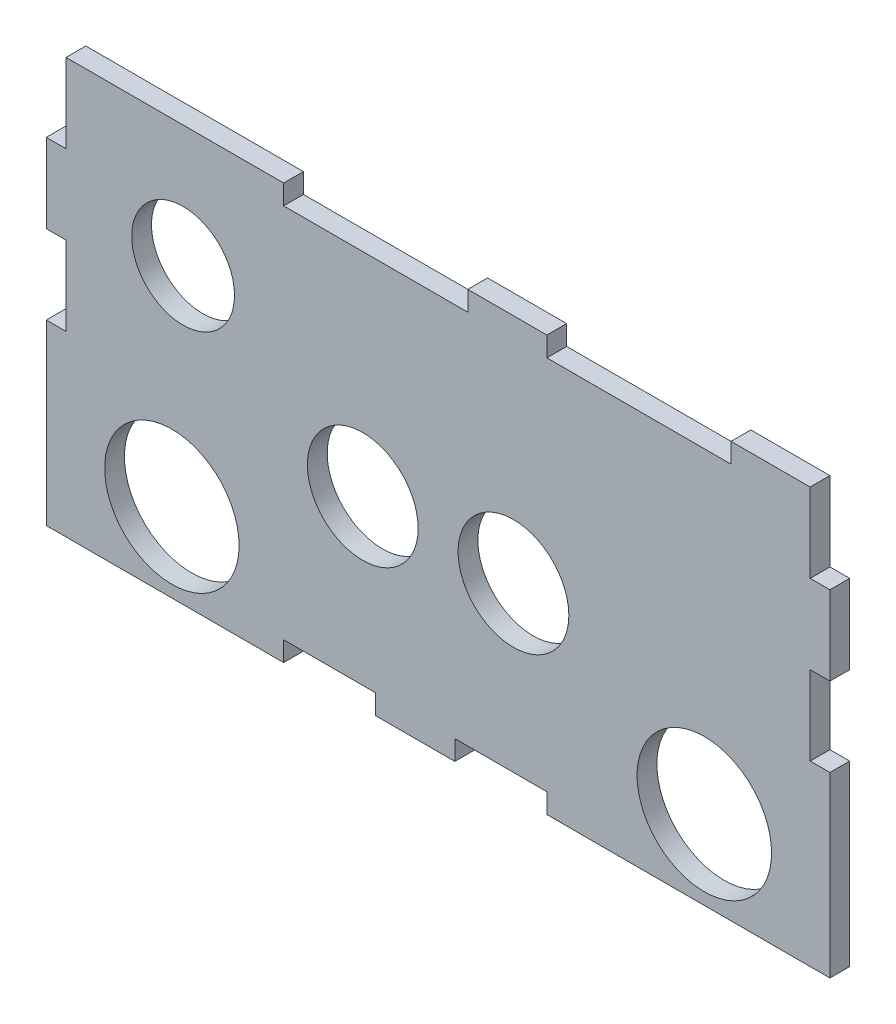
ISO-10303-21;
HEADER;
FILE_DESCRIPTION(('STEP AP214'),'2;1');
FILE_NAME('part.step','',(''),(''),'','','');
FILE_SCHEMA(('AUTOMOTIVE_DESIGN { 1 0 10303 214 1 1 1 1 }'));
ENDSEC;
DATA;
#1=APPLICATION_CONTEXT('core data for automotive mechanical design processes');
#2=APPLICATION_PROTOCOL_DEFINITION('international standard','automotive_design',2000,#1);
#3=PRODUCT_CONTEXT('',#1,'mechanical');
#4=PRODUCT('Part','Part','',(#3));
#5=PRODUCT_RELATED_PRODUCT_CATEGORY('part','',(#4));
#6=PRODUCT_DEFINITION_FORMATION('','',#4);
#7=PRODUCT_DEFINITION_CONTEXT('part definition',#1,'design');
#8=PRODUCT_DEFINITION('design','',#6,#7);
#9=PRODUCT_DEFINITION_SHAPE('','',#8);
#10=(LENGTH_UNIT() NAMED_UNIT(*) SI_UNIT(.MILLI.,.METRE.));
#11=(NAMED_UNIT(*) PLANE_ANGLE_UNIT() SI_UNIT($,.RADIAN.));
#12=(NAMED_UNIT(*) SI_UNIT($,.STERADIAN.) SOLID_ANGLE_UNIT());
#13=UNCERTAINTY_MEASURE_WITH_UNIT(LENGTH_MEASURE(1.E-05),#10,'distance_accuracy_value','');
#14=(GEOMETRIC_REPRESENTATION_CONTEXT(3) GLOBAL_UNCERTAINTY_ASSIGNED_CONTEXT((#13)) GLOBAL_UNIT_ASSIGNED_CONTEXT((#10,
#11,#12)) REPRESENTATION_CONTEXT('',''));
#15=CARTESIAN_POINT('',(0.,0.,0.));
#16=DIRECTION('',(0.,0.,1.));
#17=DIRECTION('',(1.,0.,0.));
#18=AXIS2_PLACEMENT_3D('',#15,#16,#17);
#19=CARTESIAN_POINT('',(0.,0.,5.));
#20=DIRECTION('',(0.,0.,1.));
#21=DIRECTION('',(1.,0.,0.));
#22=AXIS2_PLACEMENT_3D('',#19,#20,#21);
#23=PLANE('',#22);
#24=CARTESIAN_POINT('',(166.37,20.,5.));
#25=DIRECTION('',(0.,0.,1.));
#26=DIRECTION('',(1.,0.,0.));
#27=AXIS2_PLACEMENT_3D('',#24,#25,#26);
#28=CIRCLE('',#27,17.);
#29=CARTESIAN_POINT('',(183.37,20.,5.));
#30=VERTEX_POINT('',#29);
#31=EDGE_CURVE('E561',#30,#30,#28,.T.);
#32=ORIENTED_EDGE('',*,*,#31,.F.);
#33=EDGE_LOOP('',(#32));
#34=FACE_BOUND('',#33,.T.);
#35=CARTESIAN_POINT('',(80.01,46.3812888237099,5.));
#36=DIRECTION('',(0.,0.,1.));
#37=DIRECTION('',(1.,0.,0.));
#38=AXIS2_PLACEMENT_3D('',#35,#36,#37);
#39=CIRCLE('',#38,14.);
#40=CARTESIAN_POINT('',(94.01,46.3812888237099,5.));
#41=VERTEX_POINT('',#40);
#42=EDGE_CURVE('E573',#41,#41,#39,.T.);
#43=ORIENTED_EDGE('',*,*,#42,.F.);
#44=EDGE_LOOP('',(#43));
#45=FACE_BOUND('',#44,.T.);
#46=DIRECTION('',(1.,0.,0.));
#47=VECTOR('',#46,1.);
#48=CARTESIAN_POINT('',(0.,0.,5.));
#49=LINE('',#48,#47);
#50=CARTESIAN_POINT('',(0.,0.,5.));
#51=VERTEX_POINT('',#50);
#52=CARTESIAN_POINT('',(60.,0.,5.));
#53=VERTEX_POINT('',#52);
#54=EDGE_CURVE('E343',#51,#53,#49,.T.);
#55=ORIENTED_EDGE('',*,*,#54,.T.);
#56=DIRECTION('',(0.,1.,0.));
#57=VECTOR('',#56,1.);
#58=CARTESIAN_POINT('',(60.,0.,5.));
#59=LINE('',#58,#57);
#60=CARTESIAN_POINT('',(60.,5.,5.));
#61=VERTEX_POINT('',#60);
#62=EDGE_CURVE('E171',#53,#61,#59,.T.);
#63=ORIENTED_EDGE('',*,*,#62,.T.);
#64=DIRECTION('',(1.,0.,0.));
#65=VECTOR('',#64,1.);
#66=CARTESIAN_POINT('',(60.,5.,5.));
#67=LINE('',#66,#65);
#68=CARTESIAN_POINT('',(83.28,5.,5.));
#69=VERTEX_POINT('',#68);
#70=EDGE_CURVE('E430',#61,#69,#67,.T.);
#71=ORIENTED_EDGE('',*,*,#70,.T.);
#72=DIRECTION('',(0.,-1.,0.));
#73=VECTOR('',#72,1.);
#74=CARTESIAN_POINT('',(83.28,5.,5.));
#75=LINE('',#74,#73);
#76=CARTESIAN_POINT('',(83.28,0.,5.));
#77=VERTEX_POINT('',#76);
#78=EDGE_CURVE('E449',#69,#77,#75,.T.);
#79=ORIENTED_EDGE('',*,*,#78,.T.);
#80=DIRECTION('',(1.,0.,0.));
#81=VECTOR('',#80,1.);
#82=CARTESIAN_POINT('',(83.28,0.,5.));
#83=LINE('',#82,#81);
#84=CARTESIAN_POINT('',(103.28,0.,5.));
#85=VERTEX_POINT('',#84);
#86=EDGE_CURVE('E446',#77,#85,#83,.T.);
#87=ORIENTED_EDGE('',*,*,#86,.T.);
#88=DIRECTION('',(0.,1.,0.));
#89=VECTOR('',#88,1.);
#90=CARTESIAN_POINT('',(103.28,0.,5.));
#91=LINE('',#90,#89);
#92=CARTESIAN_POINT('',(103.28,5.,5.));
#93=VERTEX_POINT('',#92);
#94=EDGE_CURVE('E448',#85,#93,#91,.T.);
#95=ORIENTED_EDGE('',*,*,#94,.T.);
#96=DIRECTION('',(1.,0.,0.));
#97=VECTOR('',#96,1.);
#98=CARTESIAN_POINT('',(103.28,5.,5.));
#99=LINE('',#98,#97);
#100=CARTESIAN_POINT('',(126.56,5.,5.));
#101=VERTEX_POINT('',#100);
#102=EDGE_CURVE('E451',#93,#101,#99,.T.);
#103=ORIENTED_EDGE('',*,*,#102,.T.);
#104=DIRECTION('',(0.,-1.,0.));
#105=VECTOR('',#104,1.);
#106=CARTESIAN_POINT('',(126.56,5.,5.));
#107=LINE('',#106,#105);
#108=CARTESIAN_POINT('',(126.56,0.,5.));
#109=VERTEX_POINT('',#108);
#110=EDGE_CURVE('E457',#101,#109,#107,.T.);
#111=ORIENTED_EDGE('',*,*,#110,.T.);
#112=DIRECTION('',(1.,0.,0.));
#113=VECTOR('',#112,1.);
#114=CARTESIAN_POINT('',(126.56,0.,5.));
#115=LINE('',#114,#113);
#116=CARTESIAN_POINT('',(198.12,0.,5.));
#117=VERTEX_POINT('',#116);
#118=EDGE_CURVE('E459',#109,#117,#115,.T.);
#119=ORIENTED_EDGE('',*,*,#118,.T.);
#120=DIRECTION('',(0.,1.,0.));
#121=VECTOR('',#120,1.);
#122=CARTESIAN_POINT('',(198.12,45.,5.));
#123=LINE('',#122,#121);
#124=CARTESIAN_POINT('',(198.12,45.,5.));
#125=VERTEX_POINT('',#124);
#126=EDGE_CURVE('E461',#117,#125,#123,.T.);
#127=ORIENTED_EDGE('',*,*,#126,.T.);
#128=DIRECTION('',(-1.,0.,0.));
#129=VECTOR('',#128,1.);
#130=CARTESIAN_POINT('',(193.12,45.,5.));
#131=LINE('',#130,#129);
#132=CARTESIAN_POINT('',(193.12,45.,5.));
#133=VERTEX_POINT('',#132);
#134=EDGE_CURVE('E463',#125,#133,#131,.T.);
#135=ORIENTED_EDGE('',*,*,#134,.T.);
#136=DIRECTION('',(0.,1.,0.));
#137=VECTOR('',#136,1.);
#138=CARTESIAN_POINT('',(193.12,65.,5.));
#139=LINE('',#138,#137);
#140=CARTESIAN_POINT('',(193.12,65.,5.));
#141=VERTEX_POINT('',#140);
#142=EDGE_CURVE('E465',#133,#141,#139,.T.);
#143=ORIENTED_EDGE('',*,*,#142,.T.);
#144=DIRECTION('',(1.,0.,0.));
#145=VECTOR('',#144,1.);
#146=CARTESIAN_POINT('',(198.12,65.,5.));
#147=LINE('',#146,#145);
#148=CARTESIAN_POINT('',(198.12,65.,5.));
#149=VERTEX_POINT('',#148);
#150=EDGE_CURVE('E467',#141,#149,#147,.T.);
#151=ORIENTED_EDGE('',*,*,#150,.T.);
#152=DIRECTION('',(0.,1.,0.));
#153=VECTOR('',#152,1.);
#154=CARTESIAN_POINT('',(198.12,85.,5.));
#155=LINE('',#154,#153);
#156=CARTESIAN_POINT('',(198.12,85.,5.));
#157=VERTEX_POINT('',#156);
#158=EDGE_CURVE('E469',#149,#157,#155,.T.);
#159=ORIENTED_EDGE('',*,*,#158,.T.);
#160=DIRECTION('',(-1.,0.,0.));
#161=VECTOR('',#160,1.);
#162=CARTESIAN_POINT('',(193.12,85.,5.));
#163=LINE('',#162,#161);
#164=CARTESIAN_POINT('',(193.12,85.,5.));
#165=VERTEX_POINT('',#164);
#166=EDGE_CURVE('E471',#157,#165,#163,.T.);
#167=ORIENTED_EDGE('',*,*,#166,.T.);
#168=DIRECTION('',(0.,1.,0.));
#169=VECTOR('',#168,1.);
#170=CARTESIAN_POINT('',(193.12,105.,5.));
#171=LINE('',#170,#169);
#172=CARTESIAN_POINT('',(193.12,105.,5.));
#173=VERTEX_POINT('',#172);
#174=EDGE_CURVE('E473',#165,#173,#171,.T.);
#175=ORIENTED_EDGE('',*,*,#174,.T.);
#176=DIRECTION('',(-1.,0.,0.));
#177=VECTOR('',#176,1.);
#178=CARTESIAN_POINT('',(173.12,105.,5.));
#179=LINE('',#178,#177);
#180=CARTESIAN_POINT('',(173.12,105.,5.));
#181=VERTEX_POINT('',#180);
#182=EDGE_CURVE('E475',#173,#181,#179,.T.);
#183=ORIENTED_EDGE('',*,*,#182,.T.);
#184=DIRECTION('',(0.,-1.,0.));
#185=VECTOR('',#184,1.);
#186=CARTESIAN_POINT('',(173.12,100.,5.));
#187=LINE('',#186,#185);
#188=CARTESIAN_POINT('',(173.12,100.,5.));
#189=VERTEX_POINT('',#188);
#190=EDGE_CURVE('E477',#181,#189,#187,.T.);
#191=ORIENTED_EDGE('',*,*,#190,.T.);
#192=DIRECTION('',(-1.,0.,0.));
#193=VECTOR('',#192,1.);
#194=CARTESIAN_POINT('',(126.56,100.,5.));
#195=LINE('',#194,#193);
#196=CARTESIAN_POINT('',(126.56,100.,5.));
#197=VERTEX_POINT('',#196);
#198=EDGE_CURVE('E479',#189,#197,#195,.T.);
#199=ORIENTED_EDGE('',*,*,#198,.T.);
#200=DIRECTION('',(0.,1.,0.));
#201=VECTOR('',#200,1.);
#202=CARTESIAN_POINT('',(126.56,105.,5.));
#203=LINE('',#202,#201);
#204=CARTESIAN_POINT('',(126.56,105.,5.));
#205=VERTEX_POINT('',#204);
#206=EDGE_CURVE('E481',#197,#205,#203,.T.);
#207=ORIENTED_EDGE('',*,*,#206,.T.);
#208=DIRECTION('',(-1.,0.,0.));
#209=VECTOR('',#208,1.);
#210=CARTESIAN_POINT('',(106.56,105.,5.));
#211=LINE('',#210,#209);
#212=CARTESIAN_POINT('',(106.56,105.,5.));
#213=VERTEX_POINT('',#212);
#214=EDGE_CURVE('E483',#205,#213,#211,.T.);
#215=ORIENTED_EDGE('',*,*,#214,.T.);
#216=DIRECTION('',(0.,-1.,0.));
#217=VECTOR('',#216,1.);
#218=CARTESIAN_POINT('',(106.56,100.,5.));
#219=LINE('',#218,#217);
#220=CARTESIAN_POINT('',(106.56,100.,5.));
#221=VERTEX_POINT('',#220);
#222=EDGE_CURVE('E485',#213,#221,#219,.T.);
#223=ORIENTED_EDGE('',*,*,#222,.T.);
#224=DIRECTION('',(-1.,0.,0.));
#225=VECTOR('',#224,1.);
#226=CARTESIAN_POINT('',(60.,100.,5.));
#227=LINE('',#226,#225);
#228=CARTESIAN_POINT('',(60.,100.,5.));
#229=VERTEX_POINT('',#228);
#230=EDGE_CURVE('E487',#221,#229,#227,.T.);
#231=ORIENTED_EDGE('',*,*,#230,.T.);
#232=DIRECTION('',(0.,1.,0.));
#233=VECTOR('',#232,1.);
#234=CARTESIAN_POINT('',(60.,105.,5.));
#235=LINE('',#234,#233);
#236=CARTESIAN_POINT('',(60.,105.,5.));
#237=VERTEX_POINT('',#236);
#238=EDGE_CURVE('E489',#229,#237,#235,.T.);
#239=ORIENTED_EDGE('',*,*,#238,.T.);
#240=DIRECTION('',(-1.,0.,0.));
#241=VECTOR('',#240,1.);
#242=CARTESIAN_POINT('',(5.,105.,5.));
#243=LINE('',#242,#241);
#244=CARTESIAN_POINT('',(5.,105.,5.));
#245=VERTEX_POINT('',#244);
#246=EDGE_CURVE('E491',#237,#245,#243,.T.);
#247=ORIENTED_EDGE('',*,*,#246,.T.);
#248=DIRECTION('',(0.,-1.,0.));
#249=VECTOR('',#248,1.);
#250=CARTESIAN_POINT('',(5.,85.,5.));
#251=LINE('',#250,#249);
#252=CARTESIAN_POINT('',(5.,85.,5.));
#253=VERTEX_POINT('',#252);
#254=EDGE_CURVE('E493',#245,#253,#251,.T.);
#255=ORIENTED_EDGE('',*,*,#254,.T.);
#256=DIRECTION('',(-1.,0.,0.));
#257=VECTOR('',#256,1.);
#258=CARTESIAN_POINT('',(0.,85.,5.));
#259=LINE('',#258,#257);
#260=CARTESIAN_POINT('',(0.,85.,5.));
#261=VERTEX_POINT('',#260);
#262=EDGE_CURVE('E495',#253,#261,#259,.T.);
#263=ORIENTED_EDGE('',*,*,#262,.T.);
#264=DIRECTION('',(0.,-1.,0.));
#265=VECTOR('',#264,1.);
#266=CARTESIAN_POINT('',(0.,65.,5.));
#267=LINE('',#266,#265);
#268=CARTESIAN_POINT('',(0.,65.,5.));
#269=VERTEX_POINT('',#268);
#270=EDGE_CURVE('E497',#261,#269,#267,.T.);
#271=ORIENTED_EDGE('',*,*,#270,.T.);
#272=DIRECTION('',(1.,0.,0.));
#273=VECTOR('',#272,1.);
#274=CARTESIAN_POINT('',(5.,65.,5.));
#275=LINE('',#274,#273);
#276=CARTESIAN_POINT('',(5.,65.,5.));
#277=VERTEX_POINT('',#276);
#278=EDGE_CURVE('E262',#269,#277,#275,.T.);
#279=ORIENTED_EDGE('',*,*,#278,.T.);
#280=DIRECTION('',(0.,-1.,0.));
#281=VECTOR('',#280,1.);
#282=CARTESIAN_POINT('',(5.,45.,5.));
#283=LINE('',#282,#281);
#284=CARTESIAN_POINT('',(5.,45.,5.));
#285=VERTEX_POINT('',#284);
#286=EDGE_CURVE('E256',#277,#285,#283,.T.);
#287=ORIENTED_EDGE('',*,*,#286,.T.);
#288=DIRECTION('',(-1.,0.,0.));
#289=VECTOR('',#288,1.);
#290=CARTESIAN_POINT('',(0.,45.,5.));
#291=LINE('',#290,#289);
#292=CARTESIAN_POINT('',(0.,45.,5.));
#293=VERTEX_POINT('',#292);
#294=EDGE_CURVE('E260',#285,#293,#291,.T.);
#295=ORIENTED_EDGE('',*,*,#294,.T.);
#296=DIRECTION('',(0.,-1.,0.));
#297=VECTOR('',#296,1.);
#298=CARTESIAN_POINT('',(0.,0.,5.));
#299=LINE('',#298,#297);
#300=EDGE_CURVE('E56',#293,#51,#299,.T.);
#301=ORIENTED_EDGE('',*,*,#300,.T.);
#302=EDGE_LOOP('',(#55,#63,#71,#79,#87,#95,#103,#111,#119,#127,#135,#143,#151,#159,#167,#175,
#183,#191,#199,#207,#215,#223,#231,#239,#247,#255,#263,#271,#279,#287,#295,#301));
#303=FACE_BOUND('',#302,.T.);
#304=CARTESIAN_POINT('',(31.75,20.,5.));
#305=DIRECTION('',(0.,0.,1.));
#306=DIRECTION('',(1.,0.,0.));
#307=AXIS2_PLACEMENT_3D('',#304,#305,#306);
#308=CIRCLE('',#307,17.);
#309=CARTESIAN_POINT('',(48.75,20.,5.));
#310=VERTEX_POINT('',#309);
#311=EDGE_CURVE('E284',#310,#310,#308,.T.);
#312=ORIENTED_EDGE('',*,*,#311,.F.);
#313=EDGE_LOOP('',(#312));
#314=FACE_BOUND('',#313,.T.);
#315=CARTESIAN_POINT('',(118.11,46.3812888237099,5.));
#316=DIRECTION('',(0.,0.,1.));
#317=DIRECTION('',(1.,0.,0.));
#318=AXIS2_PLACEMENT_3D('',#315,#316,#317);
#319=CIRCLE('',#318,14.);
#320=CARTESIAN_POINT('',(132.11,46.3812888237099,5.));
#321=VERTEX_POINT('',#320);
#322=EDGE_CURVE('E567',#321,#321,#319,.T.);
#323=ORIENTED_EDGE('',*,*,#322,.F.);
#324=EDGE_LOOP('',(#323));
#325=FACE_BOUND('',#324,.T.);
#326=CARTESIAN_POINT('',(34.591,74.1755592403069,5.));
#327=DIRECTION('',(0.,0.,1.));
#328=DIRECTION('',(1.,0.,0.));
#329=AXIS2_PLACEMENT_3D('',#326,#327,#328);
#330=CIRCLE('',#329,13.);
#331=CARTESIAN_POINT('',(47.591,74.1755592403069,5.));
#332=VERTEX_POINT('',#331);
#333=EDGE_CURVE('E552',#332,#332,#330,.T.);
#334=ORIENTED_EDGE('',*,*,#333,.F.);
#335=EDGE_LOOP('',(#334));
#336=FACE_BOUND('',#335,.T.);
#337=ADVANCED_FACE('F39',(#34,#45,#303,#314,#325,#336),#23,.T.);
#338=CARTESIAN_POINT('',(0.,0.,0.));
#339=DIRECTION('',(0.,0.,1.));
#340=DIRECTION('',(1.,0.,0.));
#341=AXIS2_PLACEMENT_3D('',#338,#339,#340);
#342=PLANE('',#341);
#343=DIRECTION('',(1.,0.,0.));
#344=VECTOR('',#343,1.);
#345=CARTESIAN_POINT('',(0.,0.,0.));
#346=LINE('',#345,#344);
#347=CARTESIAN_POINT('',(0.,0.,0.));
#348=VERTEX_POINT('',#347);
#349=CARTESIAN_POINT('',(60.,0.,0.));
#350=VERTEX_POINT('',#349);
#351=EDGE_CURVE('E280',#348,#350,#346,.T.);
#352=ORIENTED_EDGE('',*,*,#351,.F.);
#353=DIRECTION('',(0.,-1.,0.));
#354=VECTOR('',#353,1.);
#355=CARTESIAN_POINT('',(0.,0.,0.));
#356=LINE('',#355,#354);
#357=CARTESIAN_POINT('',(0.,45.,0.));
#358=VERTEX_POINT('',#357);
#359=EDGE_CURVE('E163',#358,#348,#356,.T.);
#360=ORIENTED_EDGE('',*,*,#359,.F.);
#361=DIRECTION('',(-1.,0.,0.));
#362=VECTOR('',#361,1.);
#363=CARTESIAN_POINT('',(0.,45.,0.));
#364=LINE('',#363,#362);
#365=CARTESIAN_POINT('',(5.,45.,0.));
#366=VERTEX_POINT('',#365);
#367=EDGE_CURVE('E157',#366,#358,#364,.T.);
#368=ORIENTED_EDGE('',*,*,#367,.F.);
#369=DIRECTION('',(0.,-1.,0.));
#370=VECTOR('',#369,1.);
#371=CARTESIAN_POINT('',(5.,45.,0.));
#372=LINE('',#371,#370);
#373=CARTESIAN_POINT('',(5.,65.,0.));
#374=VERTEX_POINT('',#373);
#375=EDGE_CURVE('E270',#374,#366,#372,.T.);
#376=ORIENTED_EDGE('',*,*,#375,.F.);
#377=DIRECTION('',(1.,0.,0.));
#378=VECTOR('',#377,1.);
#379=CARTESIAN_POINT('',(5.,65.,0.));
#380=LINE('',#379,#378);
#381=CARTESIAN_POINT('',(0.,65.,0.));
#382=VERTEX_POINT('',#381);
#383=EDGE_CURVE('E338',#382,#374,#380,.T.);
#384=ORIENTED_EDGE('',*,*,#383,.F.);
#385=DIRECTION('',(0.,-1.,0.));
#386=VECTOR('',#385,1.);
#387=CARTESIAN_POINT('',(0.,65.,0.));
#388=LINE('',#387,#386);
#389=CARTESIAN_POINT('',(0.,85.,0.));
#390=VERTEX_POINT('',#389);
#391=EDGE_CURVE('E336',#390,#382,#388,.T.);
#392=ORIENTED_EDGE('',*,*,#391,.F.);
#393=DIRECTION('',(-1.,0.,0.));
#394=VECTOR('',#393,1.);
#395=CARTESIAN_POINT('',(0.,85.,0.));
#396=LINE('',#395,#394);
#397=CARTESIAN_POINT('',(5.,85.,0.));
#398=VERTEX_POINT('',#397);
#399=EDGE_CURVE('E334',#398,#390,#396,.T.);
#400=ORIENTED_EDGE('',*,*,#399,.F.);
#401=DIRECTION('',(0.,-1.,0.));
#402=VECTOR('',#401,1.);
#403=CARTESIAN_POINT('',(5.,85.,0.));
#404=LINE('',#403,#402);
#405=CARTESIAN_POINT('',(5.,105.,0.));
#406=VERTEX_POINT('',#405);
#407=EDGE_CURVE('E332',#406,#398,#404,.T.);
#408=ORIENTED_EDGE('',*,*,#407,.F.);
#409=DIRECTION('',(-1.,0.,0.));
#410=VECTOR('',#409,1.);
#411=CARTESIAN_POINT('',(5.,105.,0.));
#412=LINE('',#411,#410);
#413=CARTESIAN_POINT('',(60.,105.,0.));
#414=VERTEX_POINT('',#413);
#415=EDGE_CURVE('E330',#414,#406,#412,.T.);
#416=ORIENTED_EDGE('',*,*,#415,.F.);
#417=DIRECTION('',(0.,1.,0.));
#418=VECTOR('',#417,1.);
#419=CARTESIAN_POINT('',(60.,105.,0.));
#420=LINE('',#419,#418);
#421=CARTESIAN_POINT('',(60.,100.,0.));
#422=VERTEX_POINT('',#421);
#423=EDGE_CURVE('E328',#422,#414,#420,.T.);
#424=ORIENTED_EDGE('',*,*,#423,.F.);
#425=DIRECTION('',(-1.,0.,0.));
#426=VECTOR('',#425,1.);
#427=CARTESIAN_POINT('',(60.,100.,0.));
#428=LINE('',#427,#426);
#429=CARTESIAN_POINT('',(106.56,100.,0.));
#430=VERTEX_POINT('',#429);
#431=EDGE_CURVE('E326',#430,#422,#428,.T.);
#432=ORIENTED_EDGE('',*,*,#431,.F.);
#433=DIRECTION('',(0.,-1.,0.));
#434=VECTOR('',#433,1.);
#435=CARTESIAN_POINT('',(106.56,100.,0.));
#436=LINE('',#435,#434);
#437=CARTESIAN_POINT('',(106.56,105.,0.));
#438=VERTEX_POINT('',#437);
#439=EDGE_CURVE('E324',#438,#430,#436,.T.);
#440=ORIENTED_EDGE('',*,*,#439,.F.);
#441=DIRECTION('',(-1.,0.,0.));
#442=VECTOR('',#441,1.);
#443=CARTESIAN_POINT('',(106.56,105.,0.));
#444=LINE('',#443,#442);
#445=CARTESIAN_POINT('',(126.56,105.,0.));
#446=VERTEX_POINT('',#445);
#447=EDGE_CURVE('E322',#446,#438,#444,.T.);
#448=ORIENTED_EDGE('',*,*,#447,.F.);
#449=DIRECTION('',(0.,1.,0.));
#450=VECTOR('',#449,1.);
#451=CARTESIAN_POINT('',(126.56,105.,0.));
#452=LINE('',#451,#450);
#453=CARTESIAN_POINT('',(126.56,100.,0.));
#454=VERTEX_POINT('',#453);
#455=EDGE_CURVE('E320',#454,#446,#452,.T.);
#456=ORIENTED_EDGE('',*,*,#455,.F.);
#457=DIRECTION('',(-1.,0.,0.));
#458=VECTOR('',#457,1.);
#459=CARTESIAN_POINT('',(126.56,100.,0.));
#460=LINE('',#459,#458);
#461=CARTESIAN_POINT('',(173.12,100.,0.));
#462=VERTEX_POINT('',#461);
#463=EDGE_CURVE('E318',#462,#454,#460,.T.);
#464=ORIENTED_EDGE('',*,*,#463,.F.);
#465=DIRECTION('',(0.,-1.,0.));
#466=VECTOR('',#465,1.);
#467=CARTESIAN_POINT('',(173.12,100.,0.));
#468=LINE('',#467,#466);
#469=CARTESIAN_POINT('',(173.12,105.,0.));
#470=VERTEX_POINT('',#469);
#471=EDGE_CURVE('E316',#470,#462,#468,.T.);
#472=ORIENTED_EDGE('',*,*,#471,.F.);
#473=DIRECTION('',(-1.,0.,0.));
#474=VECTOR('',#473,1.);
#475=CARTESIAN_POINT('',(173.12,105.,0.));
#476=LINE('',#475,#474);
#477=CARTESIAN_POINT('',(193.12,105.,0.));
#478=VERTEX_POINT('',#477);
#479=EDGE_CURVE('E314',#478,#470,#476,.T.);
#480=ORIENTED_EDGE('',*,*,#479,.F.);
#481=DIRECTION('',(0.,1.,0.));
#482=VECTOR('',#481,1.);
#483=CARTESIAN_POINT('',(193.12,105.,0.));
#484=LINE('',#483,#482);
#485=CARTESIAN_POINT('',(193.12,85.,0.));
#486=VERTEX_POINT('',#485);
#487=EDGE_CURVE('E312',#486,#478,#484,.T.);
#488=ORIENTED_EDGE('',*,*,#487,.F.);
#489=DIRECTION('',(-1.,0.,0.));
#490=VECTOR('',#489,1.);
#491=CARTESIAN_POINT('',(193.12,85.,0.));
#492=LINE('',#491,#490);
#493=CARTESIAN_POINT('',(198.12,85.,0.));
#494=VERTEX_POINT('',#493);
#495=EDGE_CURVE('E310',#494,#486,#492,.T.);
#496=ORIENTED_EDGE('',*,*,#495,.F.);
#497=DIRECTION('',(0.,1.,0.));
#498=VECTOR('',#497,1.);
#499=CARTESIAN_POINT('',(198.12,85.,0.));
#500=LINE('',#499,#498);
#501=CARTESIAN_POINT('',(198.12,65.,0.));
#502=VERTEX_POINT('',#501);
#503=EDGE_CURVE('E308',#502,#494,#500,.T.);
#504=ORIENTED_EDGE('',*,*,#503,.F.);
#505=DIRECTION('',(1.,0.,0.));
#506=VECTOR('',#505,1.);
#507=CARTESIAN_POINT('',(198.12,65.,0.));
#508=LINE('',#507,#506);
#509=CARTESIAN_POINT('',(193.12,65.,0.));
#510=VERTEX_POINT('',#509);
#511=EDGE_CURVE('E306',#510,#502,#508,.T.);
#512=ORIENTED_EDGE('',*,*,#511,.F.);
#513=DIRECTION('',(0.,1.,0.));
#514=VECTOR('',#513,1.);
#515=CARTESIAN_POINT('',(193.12,65.,0.));
#516=LINE('',#515,#514);
#517=CARTESIAN_POINT('',(193.12,45.,0.));
#518=VERTEX_POINT('',#517);
#519=EDGE_CURVE('E304',#518,#510,#516,.T.);
#520=ORIENTED_EDGE('',*,*,#519,.F.);
#521=DIRECTION('',(-1.,0.,0.));
#522=VECTOR('',#521,1.);
#523=CARTESIAN_POINT('',(193.12,45.,0.));
#524=LINE('',#523,#522);
#525=CARTESIAN_POINT('',(198.12,45.,0.));
#526=VERTEX_POINT('',#525);
#527=EDGE_CURVE('E302',#526,#518,#524,.T.);
#528=ORIENTED_EDGE('',*,*,#527,.F.);
#529=DIRECTION('',(0.,1.,0.));
#530=VECTOR('',#529,1.);
#531=CARTESIAN_POINT('',(198.12,45.,0.));
#532=LINE('',#531,#530);
#533=CARTESIAN_POINT('',(198.12,0.,0.));
#534=VERTEX_POINT('',#533);
#535=EDGE_CURVE('E300',#534,#526,#532,.T.);
#536=ORIENTED_EDGE('',*,*,#535,.F.);
#537=DIRECTION('',(1.,0.,0.));
#538=VECTOR('',#537,1.);
#539=CARTESIAN_POINT('',(126.56,0.,0.));
#540=LINE('',#539,#538);
#541=CARTESIAN_POINT('',(126.56,0.,0.));
#542=VERTEX_POINT('',#541);
#543=EDGE_CURVE('E298',#542,#534,#540,.T.);
#544=ORIENTED_EDGE('',*,*,#543,.F.);
#545=DIRECTION('',(0.,-1.,0.));
#546=VECTOR('',#545,1.);
#547=CARTESIAN_POINT('',(126.56,5.,0.));
#548=LINE('',#547,#546);
#549=CARTESIAN_POINT('',(126.56,5.,0.));
#550=VERTEX_POINT('',#549);
#551=EDGE_CURVE('E296',#550,#542,#548,.T.);
#552=ORIENTED_EDGE('',*,*,#551,.F.);
#553=DIRECTION('',(1.,0.,0.));
#554=VECTOR('',#553,1.);
#555=CARTESIAN_POINT('',(103.28,5.,0.));
#556=LINE('',#555,#554);
#557=CARTESIAN_POINT('',(103.28,5.,0.));
#558=VERTEX_POINT('',#557);
#559=EDGE_CURVE('E294',#558,#550,#556,.T.);
#560=ORIENTED_EDGE('',*,*,#559,.F.);
#561=DIRECTION('',(0.,1.,0.));
#562=VECTOR('',#561,1.);
#563=CARTESIAN_POINT('',(103.28,0.,0.));
#564=LINE('',#563,#562);
#565=CARTESIAN_POINT('',(103.28,0.,0.));
#566=VERTEX_POINT('',#565);
#567=EDGE_CURVE('E292',#566,#558,#564,.T.);
#568=ORIENTED_EDGE('',*,*,#567,.F.);
#569=DIRECTION('',(1.,0.,0.));
#570=VECTOR('',#569,1.);
#571=CARTESIAN_POINT('',(83.28,0.,0.));
#572=LINE('',#571,#570);
#573=CARTESIAN_POINT('',(83.28,0.,0.));
#574=VERTEX_POINT('',#573);
#575=EDGE_CURVE('E290',#574,#566,#572,.T.);
#576=ORIENTED_EDGE('',*,*,#575,.F.);
#577=DIRECTION('',(0.,-1.,0.));
#578=VECTOR('',#577,1.);
#579=CARTESIAN_POINT('',(83.28,5.,0.));
#580=LINE('',#579,#578);
#581=CARTESIAN_POINT('',(83.28,5.,0.));
#582=VERTEX_POINT('',#581);
#583=EDGE_CURVE('E288',#582,#574,#580,.T.);
#584=ORIENTED_EDGE('',*,*,#583,.F.);
#585=DIRECTION('',(1.,0.,0.));
#586=VECTOR('',#585,1.);
#587=CARTESIAN_POINT('',(60.,5.,0.));
#588=LINE('',#587,#586);
#589=CARTESIAN_POINT('',(60.,5.,0.));
#590=VERTEX_POINT('',#589);
#591=EDGE_CURVE('E286',#590,#582,#588,.T.);
#592=ORIENTED_EDGE('',*,*,#591,.F.);
#593=DIRECTION('',(0.,1.,0.));
#594=VECTOR('',#593,1.);
#595=CARTESIAN_POINT('',(60.,0.,0.));
#596=LINE('',#595,#594);
#597=EDGE_CURVE('E283',#350,#590,#596,.T.);
#598=ORIENTED_EDGE('',*,*,#597,.F.);
#599=EDGE_LOOP('',(#352,#360,#368,#376,#384,#392,#400,#408,#416,#424,#432,#440,#448,#456,#464,
#472,#480,#488,#496,#504,#512,#520,#528,#536,#544,#552,#560,#568,#576,#584,#592,#598));
#600=FACE_BOUND('',#599,.T.);
#601=CARTESIAN_POINT('',(31.75,20.,0.));
#602=DIRECTION('',(0.,0.,1.));
#603=DIRECTION('',(1.,0.,0.));
#604=AXIS2_PLACEMENT_3D('',#601,#602,#603);
#605=CIRCLE('',#604,17.);
#606=CARTESIAN_POINT('',(48.75,20.,0.));
#607=VERTEX_POINT('',#606);
#608=EDGE_CURVE('E576',#607,#607,#605,.T.);
#609=ORIENTED_EDGE('',*,*,#608,.T.);
#610=EDGE_LOOP('',(#609));
#611=FACE_BOUND('',#610,.T.);
#612=CARTESIAN_POINT('',(80.01,46.3812888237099,0.));
#613=DIRECTION('',(0.,0.,1.));
#614=DIRECTION('',(1.,0.,0.));
#615=AXIS2_PLACEMENT_3D('',#612,#613,#614);
#616=CIRCLE('',#615,14.);
#617=CARTESIAN_POINT('',(94.01,46.3812888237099,0.));
#618=VERTEX_POINT('',#617);
#619=EDGE_CURVE('E570',#618,#618,#616,.T.);
#620=ORIENTED_EDGE('',*,*,#619,.T.);
#621=EDGE_LOOP('',(#620));
#622=FACE_BOUND('',#621,.T.);
#623=CARTESIAN_POINT('',(118.11,46.3812888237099,0.));
#624=DIRECTION('',(0.,0.,1.));
#625=DIRECTION('',(1.,0.,0.));
#626=AXIS2_PLACEMENT_3D('',#623,#624,#625);
#627=CIRCLE('',#626,14.);
#628=CARTESIAN_POINT('',(132.11,46.3812888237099,0.));
#629=VERTEX_POINT('',#628);
#630=EDGE_CURVE('E564',#629,#629,#627,.T.);
#631=ORIENTED_EDGE('',*,*,#630,.T.);
#632=EDGE_LOOP('',(#631));
#633=FACE_BOUND('',#632,.T.);
#634=CARTESIAN_POINT('',(166.37,20.,0.));
#635=DIRECTION('',(0.,0.,1.));
#636=DIRECTION('',(1.,0.,0.));
#637=AXIS2_PLACEMENT_3D('',#634,#635,#636);
#638=CIRCLE('',#637,17.);
#639=CARTESIAN_POINT('',(183.37,20.,0.));
#640=VERTEX_POINT('',#639);
#641=EDGE_CURVE('E558',#640,#640,#638,.T.);
#642=ORIENTED_EDGE('',*,*,#641,.T.);
#643=EDGE_LOOP('',(#642));
#644=FACE_BOUND('',#643,.T.);
#645=CARTESIAN_POINT('',(34.591,74.1755592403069,0.));
#646=DIRECTION('',(0.,0.,1.));
#647=DIRECTION('',(1.,0.,0.));
#648=AXIS2_PLACEMENT_3D('',#645,#646,#647);
#649=CIRCLE('',#648,13.);
#650=CARTESIAN_POINT('',(47.591,74.1755592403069,0.));
#651=VERTEX_POINT('',#650);
#652=EDGE_CURVE('E555',#651,#651,#649,.T.);
#653=ORIENTED_EDGE('',*,*,#652,.T.);
#654=EDGE_LOOP('',(#653));
#655=FACE_BOUND('',#654,.T.);
#656=ADVANCED_FACE('F434',(#600,#611,#622,#633,#644,#655),#342,.F.);
#657=CARTESIAN_POINT('',(0.,0.,5.));
#658=DIRECTION('',(0.,1.,0.));
#659=DIRECTION('',(0.,0.,1.));
#660=AXIS2_PLACEMENT_3D('',#657,#658,#659);
#661=PLANE('',#660);
#662=ORIENTED_EDGE('',*,*,#351,.T.);
#663=DIRECTION('',(0.,0.,-1.));
#664=VECTOR('',#663,1.);
#665=CARTESIAN_POINT('',(60.,0.,5.));
#666=LINE('',#665,#664);
#667=EDGE_CURVE('E11',#53,#350,#666,.T.);
#668=ORIENTED_EDGE('',*,*,#667,.F.);
#669=ORIENTED_EDGE('',*,*,#54,.F.);
#670=DIRECTION('',(0.,0.,-1.));
#671=VECTOR('',#670,1.);
#672=CARTESIAN_POINT('',(0.,0.,5.));
#673=LINE('',#672,#671);
#674=EDGE_CURVE('E276',#51,#348,#673,.T.);
#675=ORIENTED_EDGE('',*,*,#674,.T.);
#676=EDGE_LOOP('',(#662,#668,#669,#675));
#677=FACE_BOUND('',#676,.T.);
#678=ADVANCED_FACE('F41',(#677),#661,.F.);
#679=CARTESIAN_POINT('',(60.,0.,5.));
#680=DIRECTION('',(-1.,0.,0.));
#681=DIRECTION('',(0.,0.,1.));
#682=AXIS2_PLACEMENT_3D('',#679,#680,#681);
#683=PLANE('',#682);
#684=ORIENTED_EDGE('',*,*,#597,.T.);
#685=DIRECTION('',(0.,0.,-1.));
#686=VECTOR('',#685,1.);
#687=CARTESIAN_POINT('',(60.,5.,5.));
#688=LINE('',#687,#686);
#689=EDGE_CURVE('E48',#61,#590,#688,.T.);
#690=ORIENTED_EDGE('',*,*,#689,.F.);
#691=ORIENTED_EDGE('',*,*,#62,.F.);
#692=ORIENTED_EDGE('',*,*,#667,.T.);
#693=EDGE_LOOP('',(#684,#690,#691,#692));
#694=FACE_BOUND('',#693,.T.);
#695=ADVANCED_FACE('F925',(#694),#683,.F.);
#696=CARTESIAN_POINT('',(60.,5.,5.));
#697=DIRECTION('',(0.,1.,0.));
#698=DIRECTION('',(0.,0.,1.));
#699=AXIS2_PLACEMENT_3D('',#696,#697,#698);
#700=PLANE('',#699);
#701=ORIENTED_EDGE('',*,*,#591,.T.);
#702=DIRECTION('',(0.,0.,-1.));
#703=VECTOR('',#702,1.);
#704=CARTESIAN_POINT('',(83.28,5.,5.));
#705=LINE('',#704,#703);
#706=EDGE_CURVE('E422',#69,#582,#705,.T.);
#707=ORIENTED_EDGE('',*,*,#706,.F.);
#708=ORIENTED_EDGE('',*,*,#70,.F.);
#709=ORIENTED_EDGE('',*,*,#689,.T.);
#710=EDGE_LOOP('',(#701,#707,#708,#709));
#711=FACE_BOUND('',#710,.T.);
#712=ADVANCED_FACE('F428',(#711),#700,.F.);
#713=CARTESIAN_POINT('',(83.28,5.,5.));
#714=DIRECTION('',(1.,0.,0.));
#715=DIRECTION('',(0.,0.,-1.));
#716=AXIS2_PLACEMENT_3D('',#713,#714,#715);
#717=PLANE('',#716);
#718=ORIENTED_EDGE('',*,*,#583,.T.);
#719=DIRECTION('',(0.,0.,-1.));
#720=VECTOR('',#719,1.);
#721=CARTESIAN_POINT('',(83.28,0.,5.));
#722=LINE('',#721,#720);
#723=EDGE_CURVE('E419',#77,#574,#722,.T.);
#724=ORIENTED_EDGE('',*,*,#723,.F.);
#725=ORIENTED_EDGE('',*,*,#78,.F.);
#726=ORIENTED_EDGE('',*,*,#706,.T.);
#727=EDGE_LOOP('',(#718,#724,#725,#726));
#728=FACE_BOUND('',#727,.T.);
#729=ADVANCED_FACE('F440',(#728),#717,.F.);
#730=CARTESIAN_POINT('',(83.28,0.,5.));
#731=DIRECTION('',(0.,1.,0.));
#732=DIRECTION('',(0.,0.,1.));
#733=AXIS2_PLACEMENT_3D('',#730,#731,#732);
#734=PLANE('',#733);
#735=ORIENTED_EDGE('',*,*,#575,.T.);
#736=DIRECTION('',(0.,0.,-1.));
#737=VECTOR('',#736,1.);
#738=CARTESIAN_POINT('',(103.28,0.,5.));
#739=LINE('',#738,#737);
#740=EDGE_CURVE('E416',#85,#566,#739,.T.);
#741=ORIENTED_EDGE('',*,*,#740,.F.);
#742=ORIENTED_EDGE('',*,*,#86,.F.);
#743=ORIENTED_EDGE('',*,*,#723,.T.);
#744=EDGE_LOOP('',(#735,#741,#742,#743));
#745=FACE_BOUND('',#744,.T.);
#746=ADVANCED_FACE('F444',(#745),#734,.F.);
#747=CARTESIAN_POINT('',(103.28,0.,5.));
#748=DIRECTION('',(-1.,0.,0.));
#749=DIRECTION('',(0.,0.,1.));
#750=AXIS2_PLACEMENT_3D('',#747,#748,#749);
#751=PLANE('',#750);
#752=ORIENTED_EDGE('',*,*,#567,.T.);
#753=DIRECTION('',(0.,0.,-1.));
#754=VECTOR('',#753,1.);
#755=CARTESIAN_POINT('',(103.28,5.,5.));
#756=LINE('',#755,#754);
#757=EDGE_CURVE('E413',#93,#558,#756,.T.);
#758=ORIENTED_EDGE('',*,*,#757,.F.);
#759=ORIENTED_EDGE('',*,*,#94,.F.);
#760=ORIENTED_EDGE('',*,*,#740,.T.);
#761=EDGE_LOOP('',(#752,#758,#759,#760));
#762=FACE_BOUND('',#761,.T.);
#763=ADVANCED_FACE('F886',(#762),#751,.F.);
#764=CARTESIAN_POINT('',(103.28,5.,5.));
#765=DIRECTION('',(0.,1.,0.));
#766=DIRECTION('',(0.,0.,1.));
#767=AXIS2_PLACEMENT_3D('',#764,#765,#766);
#768=PLANE('',#767);
#769=ORIENTED_EDGE('',*,*,#559,.T.);
#770=DIRECTION('',(0.,0.,-1.));
#771=VECTOR('',#770,1.);
#772=CARTESIAN_POINT('',(126.56,5.,5.));
#773=LINE('',#772,#771);
#774=EDGE_CURVE('E410',#101,#550,#773,.T.);
#775=ORIENTED_EDGE('',*,*,#774,.F.);
#776=ORIENTED_EDGE('',*,*,#102,.F.);
#777=ORIENTED_EDGE('',*,*,#757,.T.);
#778=EDGE_LOOP('',(#769,#775,#776,#777));
#779=FACE_BOUND('',#778,.T.);
#780=ADVANCED_FACE('F875',(#779),#768,.F.);
#781=CARTESIAN_POINT('',(126.56,5.,5.));
#782=DIRECTION('',(1.,0.,0.));
#783=DIRECTION('',(0.,0.,-1.));
#784=AXIS2_PLACEMENT_3D('',#781,#782,#783);
#785=PLANE('',#784);
#786=ORIENTED_EDGE('',*,*,#551,.T.);
#787=DIRECTION('',(0.,0.,-1.));
#788=VECTOR('',#787,1.);
#789=CARTESIAN_POINT('',(126.56,0.,5.));
#790=LINE('',#789,#788);
#791=EDGE_CURVE('E407',#109,#542,#790,.T.);
#792=ORIENTED_EDGE('',*,*,#791,.F.);
#793=ORIENTED_EDGE('',*,*,#110,.F.);
#794=ORIENTED_EDGE('',*,*,#774,.T.);
#795=EDGE_LOOP('',(#786,#792,#793,#794));
#796=FACE_BOUND('',#795,.T.);
#797=ADVANCED_FACE('F864',(#796),#785,.F.);
#798=CARTESIAN_POINT('',(126.56,0.,5.));
#799=DIRECTION('',(0.,1.,0.));
#800=DIRECTION('',(0.,0.,1.));
#801=AXIS2_PLACEMENT_3D('',#798,#799,#800);
#802=PLANE('',#801);
#803=ORIENTED_EDGE('',*,*,#543,.T.);
#804=DIRECTION('',(0.,0.,-1.));
#805=VECTOR('',#804,1.);
#806=CARTESIAN_POINT('',(198.12,0.,5.));
#807=LINE('',#806,#805);
#808=EDGE_CURVE('E404',#117,#534,#807,.T.);
#809=ORIENTED_EDGE('',*,*,#808,.F.);
#810=ORIENTED_EDGE('',*,*,#118,.F.);
#811=ORIENTED_EDGE('',*,*,#791,.T.);
#812=EDGE_LOOP('',(#803,#809,#810,#811));
#813=FACE_BOUND('',#812,.T.);
#814=ADVANCED_FACE('F853',(#813),#802,.F.);
#815=CARTESIAN_POINT('',(198.12,45.,5.));
#816=DIRECTION('',(-1.,0.,0.));
#817=DIRECTION('',(0.,0.,1.));
#818=AXIS2_PLACEMENT_3D('',#815,#816,#817);
#819=PLANE('',#818);
#820=ORIENTED_EDGE('',*,*,#535,.T.);
#821=DIRECTION('',(0.,0.,-1.));
#822=VECTOR('',#821,1.);
#823=CARTESIAN_POINT('',(198.12,45.,5.));
#824=LINE('',#823,#822);
#825=EDGE_CURVE('E401',#125,#526,#824,.T.);
#826=ORIENTED_EDGE('',*,*,#825,.F.);
#827=ORIENTED_EDGE('',*,*,#126,.F.);
#828=ORIENTED_EDGE('',*,*,#808,.T.);
#829=EDGE_LOOP('',(#820,#826,#827,#828));
#830=FACE_BOUND('',#829,.T.);
#831=ADVANCED_FACE('F842',(#830),#819,.F.);
#832=CARTESIAN_POINT('',(193.12,45.,5.));
#833=DIRECTION('',(0.,-1.,0.));
#834=DIRECTION('',(0.,0.,-1.));
#835=AXIS2_PLACEMENT_3D('',#832,#833,#834);
#836=PLANE('',#835);
#837=ORIENTED_EDGE('',*,*,#527,.T.);
#838=DIRECTION('',(0.,0.,-1.));
#839=VECTOR('',#838,1.);
#840=CARTESIAN_POINT('',(193.12,45.,5.));
#841=LINE('',#840,#839);
#842=EDGE_CURVE('E398',#133,#518,#841,.T.);
#843=ORIENTED_EDGE('',*,*,#842,.F.);
#844=ORIENTED_EDGE('',*,*,#134,.F.);
#845=ORIENTED_EDGE('',*,*,#825,.T.);
#846=EDGE_LOOP('',(#837,#843,#844,#845));
#847=FACE_BOUND('',#846,.T.);
#848=ADVANCED_FACE('F831',(#847),#836,.F.);
#849=CARTESIAN_POINT('',(193.12,65.,5.));
#850=DIRECTION('',(-1.,0.,0.));
#851=DIRECTION('',(0.,0.,1.));
#852=AXIS2_PLACEMENT_3D('',#849,#850,#851);
#853=PLANE('',#852);
#854=ORIENTED_EDGE('',*,*,#519,.T.);
#855=DIRECTION('',(0.,0.,-1.));
#856=VECTOR('',#855,1.);
#857=CARTESIAN_POINT('',(193.12,65.,5.));
#858=LINE('',#857,#856);
#859=EDGE_CURVE('E395',#141,#510,#858,.T.);
#860=ORIENTED_EDGE('',*,*,#859,.F.);
#861=ORIENTED_EDGE('',*,*,#142,.F.);
#862=ORIENTED_EDGE('',*,*,#842,.T.);
#863=EDGE_LOOP('',(#854,#860,#861,#862));
#864=FACE_BOUND('',#863,.T.);
#865=ADVANCED_FACE('F820',(#864),#853,.F.);
#866=CARTESIAN_POINT('',(198.12,65.,5.));
#867=DIRECTION('',(0.,1.,0.));
#868=DIRECTION('',(0.,0.,1.));
#869=AXIS2_PLACEMENT_3D('',#866,#867,#868);
#870=PLANE('',#869);
#871=ORIENTED_EDGE('',*,*,#511,.T.);
#872=DIRECTION('',(0.,0.,-1.));
#873=VECTOR('',#872,1.);
#874=CARTESIAN_POINT('',(198.12,65.,5.));
#875=LINE('',#874,#873);
#876=EDGE_CURVE('E392',#149,#502,#875,.T.);
#877=ORIENTED_EDGE('',*,*,#876,.F.);
#878=ORIENTED_EDGE('',*,*,#150,.F.);
#879=ORIENTED_EDGE('',*,*,#859,.T.);
#880=EDGE_LOOP('',(#871,#877,#878,#879));
#881=FACE_BOUND('',#880,.T.);
#882=ADVANCED_FACE('F809',(#881),#870,.F.);
#883=CARTESIAN_POINT('',(198.12,85.,5.));
#884=DIRECTION('',(-1.,0.,0.));
#885=DIRECTION('',(0.,0.,1.));
#886=AXIS2_PLACEMENT_3D('',#883,#884,#885);
#887=PLANE('',#886);
#888=ORIENTED_EDGE('',*,*,#503,.T.);
#889=DIRECTION('',(0.,0.,-1.));
#890=VECTOR('',#889,1.);
#891=CARTESIAN_POINT('',(198.12,85.,5.));
#892=LINE('',#891,#890);
#893=EDGE_CURVE('E389',#157,#494,#892,.T.);
#894=ORIENTED_EDGE('',*,*,#893,.F.);
#895=ORIENTED_EDGE('',*,*,#158,.F.);
#896=ORIENTED_EDGE('',*,*,#876,.T.);
#897=EDGE_LOOP('',(#888,#894,#895,#896));
#898=FACE_BOUND('',#897,.T.);
#899=ADVANCED_FACE('F798',(#898),#887,.F.);
#900=CARTESIAN_POINT('',(193.12,85.,5.));
#901=DIRECTION('',(0.,-1.,0.));
#902=DIRECTION('',(0.,0.,-1.));
#903=AXIS2_PLACEMENT_3D('',#900,#901,#902);
#904=PLANE('',#903);
#905=ORIENTED_EDGE('',*,*,#495,.T.);
#906=DIRECTION('',(0.,0.,-1.));
#907=VECTOR('',#906,1.);
#908=CARTESIAN_POINT('',(193.12,85.,5.));
#909=LINE('',#908,#907);
#910=EDGE_CURVE('E386',#165,#486,#909,.T.);
#911=ORIENTED_EDGE('',*,*,#910,.F.);
#912=ORIENTED_EDGE('',*,*,#166,.F.);
#913=ORIENTED_EDGE('',*,*,#893,.T.);
#914=EDGE_LOOP('',(#905,#911,#912,#913));
#915=FACE_BOUND('',#914,.T.);
#916=ADVANCED_FACE('F787',(#915),#904,.F.);
#917=CARTESIAN_POINT('',(193.12,105.,5.));
#918=DIRECTION('',(-1.,0.,0.));
#919=DIRECTION('',(0.,0.,1.));
#920=AXIS2_PLACEMENT_3D('',#917,#918,#919);
#921=PLANE('',#920);
#922=ORIENTED_EDGE('',*,*,#487,.T.);
#923=DIRECTION('',(0.,0.,-1.));
#924=VECTOR('',#923,1.);
#925=CARTESIAN_POINT('',(193.12,105.,5.));
#926=LINE('',#925,#924);
#927=EDGE_CURVE('E383',#173,#478,#926,.T.);
#928=ORIENTED_EDGE('',*,*,#927,.F.);
#929=ORIENTED_EDGE('',*,*,#174,.F.);
#930=ORIENTED_EDGE('',*,*,#910,.T.);
#931=EDGE_LOOP('',(#922,#928,#929,#930));
#932=FACE_BOUND('',#931,.T.);
#933=ADVANCED_FACE('F776',(#932),#921,.F.);
#934=CARTESIAN_POINT('',(173.12,105.,5.));
#935=DIRECTION('',(0.,-1.,0.));
#936=DIRECTION('',(0.,0.,-1.));
#937=AXIS2_PLACEMENT_3D('',#934,#935,#936);
#938=PLANE('',#937);
#939=ORIENTED_EDGE('',*,*,#479,.T.);
#940=DIRECTION('',(0.,0.,-1.));
#941=VECTOR('',#940,1.);
#942=CARTESIAN_POINT('',(173.12,105.,5.));
#943=LINE('',#942,#941);
#944=EDGE_CURVE('E380',#181,#470,#943,.T.);
#945=ORIENTED_EDGE('',*,*,#944,.F.);
#946=ORIENTED_EDGE('',*,*,#182,.F.);
#947=ORIENTED_EDGE('',*,*,#927,.T.);
#948=EDGE_LOOP('',(#939,#945,#946,#947));
#949=FACE_BOUND('',#948,.T.);
#950=ADVANCED_FACE('F765',(#949),#938,.F.);
#951=CARTESIAN_POINT('',(173.12,100.,5.));
#952=DIRECTION('',(1.,0.,0.));
#953=DIRECTION('',(0.,1.,0.));
#954=AXIS2_PLACEMENT_3D('',#951,#952,#953);
#955=PLANE('',#954);
#956=ORIENTED_EDGE('',*,*,#471,.T.);
#957=DIRECTION('',(0.,0.,-1.));
#958=VECTOR('',#957,1.);
#959=CARTESIAN_POINT('',(173.12,100.,5.));
#960=LINE('',#959,#958);
#961=EDGE_CURVE('E377',#189,#462,#960,.T.);
#962=ORIENTED_EDGE('',*,*,#961,.F.);
#963=ORIENTED_EDGE('',*,*,#190,.F.);
#964=ORIENTED_EDGE('',*,*,#944,.T.);
#965=EDGE_LOOP('',(#956,#962,#963,#964));
#966=FACE_BOUND('',#965,.T.);
#967=ADVANCED_FACE('F754',(#966),#955,.F.);
#968=CARTESIAN_POINT('',(126.56,100.,5.));
#969=DIRECTION('',(0.,-1.,0.));
#970=DIRECTION('',(0.,0.,-1.));
#971=AXIS2_PLACEMENT_3D('',#968,#969,#970);
#972=PLANE('',#971);
#973=ORIENTED_EDGE('',*,*,#463,.T.);
#974=DIRECTION('',(0.,0.,-1.));
#975=VECTOR('',#974,1.);
#976=CARTESIAN_POINT('',(126.56,100.,5.));
#977=LINE('',#976,#975);
#978=EDGE_CURVE('E374',#197,#454,#977,.T.);
#979=ORIENTED_EDGE('',*,*,#978,.F.);
#980=ORIENTED_EDGE('',*,*,#198,.F.);
#981=ORIENTED_EDGE('',*,*,#961,.T.);
#982=EDGE_LOOP('',(#973,#979,#980,#981));
#983=FACE_BOUND('',#982,.T.);
#984=ADVANCED_FACE('F743',(#983),#972,.F.);
#985=CARTESIAN_POINT('',(126.56,105.,5.));
#986=DIRECTION('',(-1.,0.,0.));
#987=DIRECTION('',(0.,0.,1.));
#988=AXIS2_PLACEMENT_3D('',#985,#986,#987);
#989=PLANE('',#988);
#990=ORIENTED_EDGE('',*,*,#455,.T.);
#991=DIRECTION('',(0.,0.,-1.));
#992=VECTOR('',#991,1.);
#993=CARTESIAN_POINT('',(126.56,105.,5.));
#994=LINE('',#993,#992);
#995=EDGE_CURVE('E371',#205,#446,#994,.T.);
#996=ORIENTED_EDGE('',*,*,#995,.F.);
#997=ORIENTED_EDGE('',*,*,#206,.F.);
#998=ORIENTED_EDGE('',*,*,#978,.T.);
#999=EDGE_LOOP('',(#990,#996,#997,#998));
#1000=FACE_BOUND('',#999,.T.);
#1001=ADVANCED_FACE('F732',(#1000),#989,.F.);
#1002=CARTESIAN_POINT('',(106.56,105.,5.));
#1003=DIRECTION('',(0.,-1.,0.));
#1004=DIRECTION('',(0.,0.,-1.));
#1005=AXIS2_PLACEMENT_3D('',#1002,#1003,#1004);
#1006=PLANE('',#1005);
#1007=ORIENTED_EDGE('',*,*,#447,.T.);
#1008=DIRECTION('',(0.,0.,-1.));
#1009=VECTOR('',#1008,1.);
#1010=CARTESIAN_POINT('',(106.56,105.,5.));
#1011=LINE('',#1010,#1009);
#1012=EDGE_CURVE('E368',#213,#438,#1011,.T.);
#1013=ORIENTED_EDGE('',*,*,#1012,.F.);
#1014=ORIENTED_EDGE('',*,*,#214,.F.);
#1015=ORIENTED_EDGE('',*,*,#995,.T.);
#1016=EDGE_LOOP('',(#1007,#1013,#1014,#1015));
#1017=FACE_BOUND('',#1016,.T.);
#1018=ADVANCED_FACE('F721',(#1017),#1006,.F.);
#1019=CARTESIAN_POINT('',(106.56,100.,5.));
#1020=DIRECTION('',(1.,0.,0.));
#1021=DIRECTION('',(0.,0.,-1.));
#1022=AXIS2_PLACEMENT_3D('',#1019,#1020,#1021);
#1023=PLANE('',#1022);
#1024=ORIENTED_EDGE('',*,*,#439,.T.);
#1025=DIRECTION('',(0.,0.,-1.));
#1026=VECTOR('',#1025,1.);
#1027=CARTESIAN_POINT('',(106.56,100.,5.));
#1028=LINE('',#1027,#1026);
#1029=EDGE_CURVE('E365',#221,#430,#1028,.T.);
#1030=ORIENTED_EDGE('',*,*,#1029,.F.);
#1031=ORIENTED_EDGE('',*,*,#222,.F.);
#1032=ORIENTED_EDGE('',*,*,#1012,.T.);
#1033=EDGE_LOOP('',(#1024,#1030,#1031,#1032));
#1034=FACE_BOUND('',#1033,.T.);
#1035=ADVANCED_FACE('F710',(#1034),#1023,.F.);
#1036=CARTESIAN_POINT('',(60.,100.,5.));
#1037=DIRECTION('',(0.,-1.,0.));
#1038=DIRECTION('',(0.,0.,-1.));
#1039=AXIS2_PLACEMENT_3D('',#1036,#1037,#1038);
#1040=PLANE('',#1039);
#1041=ORIENTED_EDGE('',*,*,#431,.T.);
#1042=DIRECTION('',(0.,0.,-1.));
#1043=VECTOR('',#1042,1.);
#1044=CARTESIAN_POINT('',(60.,100.,5.));
#1045=LINE('',#1044,#1043);
#1046=EDGE_CURVE('E362',#229,#422,#1045,.T.);
#1047=ORIENTED_EDGE('',*,*,#1046,.F.);
#1048=ORIENTED_EDGE('',*,*,#230,.F.);
#1049=ORIENTED_EDGE('',*,*,#1029,.T.);
#1050=EDGE_LOOP('',(#1041,#1047,#1048,#1049));
#1051=FACE_BOUND('',#1050,.T.);
#1052=ADVANCED_FACE('F699',(#1051),#1040,.F.);
#1053=CARTESIAN_POINT('',(60.,105.,5.));
#1054=DIRECTION('',(-1.,0.,0.));
#1055=DIRECTION('',(0.,0.,1.));
#1056=AXIS2_PLACEMENT_3D('',#1053,#1054,#1055);
#1057=PLANE('',#1056);
#1058=ORIENTED_EDGE('',*,*,#423,.T.);
#1059=DIRECTION('',(0.,0.,-1.));
#1060=VECTOR('',#1059,1.);
#1061=CARTESIAN_POINT('',(60.,105.,5.));
#1062=LINE('',#1061,#1060);
#1063=EDGE_CURVE('E359',#237,#414,#1062,.T.);
#1064=ORIENTED_EDGE('',*,*,#1063,.F.);
#1065=ORIENTED_EDGE('',*,*,#238,.F.);
#1066=ORIENTED_EDGE('',*,*,#1046,.T.);
#1067=EDGE_LOOP('',(#1058,#1064,#1065,#1066));
#1068=FACE_BOUND('',#1067,.T.);
#1069=ADVANCED_FACE('F688',(#1068),#1057,.F.);
#1070=CARTESIAN_POINT('',(5.,105.,5.));
#1071=DIRECTION('',(0.,-1.,0.));
#1072=DIRECTION('',(0.,0.,-1.));
#1073=AXIS2_PLACEMENT_3D('',#1070,#1071,#1072);
#1074=PLANE('',#1073);
#1075=ORIENTED_EDGE('',*,*,#415,.T.);
#1076=DIRECTION('',(0.,0.,-1.));
#1077=VECTOR('',#1076,1.);
#1078=CARTESIAN_POINT('',(5.,105.,5.));
#1079=LINE('',#1078,#1077);
#1080=EDGE_CURVE('E356',#245,#406,#1079,.T.);
#1081=ORIENTED_EDGE('',*,*,#1080,.F.);
#1082=ORIENTED_EDGE('',*,*,#246,.F.);
#1083=ORIENTED_EDGE('',*,*,#1063,.T.);
#1084=EDGE_LOOP('',(#1075,#1081,#1082,#1083));
#1085=FACE_BOUND('',#1084,.T.);
#1086=ADVANCED_FACE('F677',(#1085),#1074,.F.);
#1087=CARTESIAN_POINT('',(5.,85.,5.));
#1088=DIRECTION('',(1.,0.,0.));
#1089=DIRECTION('',(0.,0.,-1.));
#1090=AXIS2_PLACEMENT_3D('',#1087,#1088,#1089);
#1091=PLANE('',#1090);
#1092=ORIENTED_EDGE('',*,*,#407,.T.);
#1093=DIRECTION('',(0.,0.,-1.));
#1094=VECTOR('',#1093,1.);
#1095=CARTESIAN_POINT('',(5.,85.,5.));
#1096=LINE('',#1095,#1094);
#1097=EDGE_CURVE('E353',#253,#398,#1096,.T.);
#1098=ORIENTED_EDGE('',*,*,#1097,.F.);
#1099=ORIENTED_EDGE('',*,*,#254,.F.);
#1100=ORIENTED_EDGE('',*,*,#1080,.T.);
#1101=EDGE_LOOP('',(#1092,#1098,#1099,#1100));
#1102=FACE_BOUND('',#1101,.T.);
#1103=ADVANCED_FACE('F666',(#1102),#1091,.F.);
#1104=CARTESIAN_POINT('',(0.,85.,5.));
#1105=DIRECTION('',(0.,-1.,0.));
#1106=DIRECTION('',(0.,0.,-1.));
#1107=AXIS2_PLACEMENT_3D('',#1104,#1105,#1106);
#1108=PLANE('',#1107);
#1109=ORIENTED_EDGE('',*,*,#399,.T.);
#1110=DIRECTION('',(0.,0.,-1.));
#1111=VECTOR('',#1110,1.);
#1112=CARTESIAN_POINT('',(0.,85.,5.));
#1113=LINE('',#1112,#1111);
#1114=EDGE_CURVE('E350',#261,#390,#1113,.T.);
#1115=ORIENTED_EDGE('',*,*,#1114,.F.);
#1116=ORIENTED_EDGE('',*,*,#262,.F.);
#1117=ORIENTED_EDGE('',*,*,#1097,.T.);
#1118=EDGE_LOOP('',(#1109,#1115,#1116,#1117));
#1119=FACE_BOUND('',#1118,.T.);
#1120=ADVANCED_FACE('F656',(#1119),#1108,.F.);
#1121=CARTESIAN_POINT('',(0.,65.,5.));
#1122=DIRECTION('',(1.,0.,0.));
#1123=DIRECTION('',(0.,0.,-1.));
#1124=AXIS2_PLACEMENT_3D('',#1121,#1122,#1123);
#1125=PLANE('',#1124);
#1126=ORIENTED_EDGE('',*,*,#391,.T.);
#1127=DIRECTION('',(0.,0.,-1.));
#1128=VECTOR('',#1127,1.);
#1129=CARTESIAN_POINT('',(0.,65.,5.));
#1130=LINE('',#1129,#1128);
#1131=EDGE_CURVE('E347',#269,#382,#1130,.T.);
#1132=ORIENTED_EDGE('',*,*,#1131,.F.);
#1133=ORIENTED_EDGE('',*,*,#270,.F.);
#1134=ORIENTED_EDGE('',*,*,#1114,.T.);
#1135=EDGE_LOOP('',(#1126,#1132,#1133,#1134));
#1136=FACE_BOUND('',#1135,.T.);
#1137=ADVANCED_FACE('F503',(#1136),#1125,.F.);
#1138=CARTESIAN_POINT('',(5.,65.,5.));
#1139=DIRECTION('',(0.,1.,0.));
#1140=DIRECTION('',(0.,0.,1.));
#1141=AXIS2_PLACEMENT_3D('',#1138,#1139,#1140);
#1142=PLANE('',#1141);
#1143=ORIENTED_EDGE('',*,*,#383,.T.);
#1144=DIRECTION('',(0.,0.,-1.));
#1145=VECTOR('',#1144,1.);
#1146=CARTESIAN_POINT('',(5.,65.,5.));
#1147=LINE('',#1146,#1145);
#1148=EDGE_CURVE('E271',#277,#374,#1147,.T.);
#1149=ORIENTED_EDGE('',*,*,#1148,.F.);
#1150=ORIENTED_EDGE('',*,*,#278,.F.);
#1151=ORIENTED_EDGE('',*,*,#1131,.T.);
#1152=EDGE_LOOP('',(#1143,#1149,#1150,#1151));
#1153=FACE_BOUND('',#1152,.T.);
#1154=ADVANCED_FACE('F507',(#1153),#1142,.F.);
#1155=CARTESIAN_POINT('',(5.,45.,5.));
#1156=DIRECTION('',(1.,0.,0.));
#1157=DIRECTION('',(0.,1.,0.));
#1158=AXIS2_PLACEMENT_3D('',#1155,#1156,#1157);
#1159=PLANE('',#1158);
#1160=ORIENTED_EDGE('',*,*,#375,.T.);
#1161=DIRECTION('',(0.,0.,-1.));
#1162=VECTOR('',#1161,1.);
#1163=CARTESIAN_POINT('',(5.,45.,5.));
#1164=LINE('',#1163,#1162);
#1165=EDGE_CURVE('E267',#285,#366,#1164,.T.);
#1166=ORIENTED_EDGE('',*,*,#1165,.F.);
#1167=ORIENTED_EDGE('',*,*,#286,.F.);
#1168=ORIENTED_EDGE('',*,*,#1148,.T.);
#1169=EDGE_LOOP('',(#1160,#1166,#1167,#1168));
#1170=FACE_BOUND('',#1169,.T.);
#1171=ADVANCED_FACE('F268',(#1170),#1159,.F.);
#1172=CARTESIAN_POINT('',(0.,45.,5.));
#1173=DIRECTION('',(0.,-1.,0.));
#1174=DIRECTION('',(0.,0.,-1.));
#1175=AXIS2_PLACEMENT_3D('',#1172,#1173,#1174);
#1176=PLANE('',#1175);
#1177=ORIENTED_EDGE('',*,*,#367,.T.);
#1178=DIRECTION('',(0.,0.,-1.));
#1179=VECTOR('',#1178,1.);
#1180=CARTESIAN_POINT('',(0.,45.,5.));
#1181=LINE('',#1180,#1179);
#1182=EDGE_CURVE('E272',#293,#358,#1181,.T.);
#1183=ORIENTED_EDGE('',*,*,#1182,.F.);
#1184=ORIENTED_EDGE('',*,*,#294,.F.);
#1185=ORIENTED_EDGE('',*,*,#1165,.T.);
#1186=EDGE_LOOP('',(#1177,#1183,#1184,#1185));
#1187=FACE_BOUND('',#1186,.T.);
#1188=ADVANCED_FACE('F274',(#1187),#1176,.F.);
#1189=CARTESIAN_POINT('',(0.,0.,5.));
#1190=DIRECTION('',(1.,0.,0.));
#1191=DIRECTION('',(0.,0.,-1.));
#1192=AXIS2_PLACEMENT_3D('',#1189,#1190,#1191);
#1193=PLANE('',#1192);
#1194=ORIENTED_EDGE('',*,*,#359,.T.);
#1195=ORIENTED_EDGE('',*,*,#674,.F.);
#1196=ORIENTED_EDGE('',*,*,#300,.F.);
#1197=ORIENTED_EDGE('',*,*,#1182,.T.);
#1198=EDGE_LOOP('',(#1194,#1195,#1196,#1197));
#1199=FACE_BOUND('',#1198,.T.);
#1200=ADVANCED_FACE('F511',(#1199),#1193,.F.);
#1201=CARTESIAN_POINT('',(31.75,20.,5.));
#1202=DIRECTION('',(0.,0.,-1.));
#1203=DIRECTION('',(-1.,0.,0.));
#1204=AXIS2_PLACEMENT_3D('',#1201,#1202,#1203);
#1205=CYLINDRICAL_SURFACE('',#1204,17.);
#1206=ORIENTED_EDGE('',*,*,#311,.T.);
#1207=EDGE_LOOP('',(#1206));
#1208=FACE_BOUND('',#1207,.T.);
#1209=ORIENTED_EDGE('',*,*,#608,.F.);
#1210=EDGE_LOOP('',(#1209));
#1211=FACE_BOUND('',#1210,.T.);
#1212=ADVANCED_FACE('F513',(#1208,#1211),#1205,.F.);
#1213=CARTESIAN_POINT('',(80.01,46.3812888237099,5.));
#1214=DIRECTION('',(0.,0.,-1.));
#1215=DIRECTION('',(-1.,0.,0.));
#1216=AXIS2_PLACEMENT_3D('',#1213,#1214,#1215);
#1217=CYLINDRICAL_SURFACE('',#1216,14.);
#1218=ORIENTED_EDGE('',*,*,#42,.T.);
#1219=EDGE_LOOP('',(#1218));
#1220=FACE_BOUND('',#1219,.T.);
#1221=ORIENTED_EDGE('',*,*,#619,.F.);
#1222=EDGE_LOOP('',(#1221));
#1223=FACE_BOUND('',#1222,.T.);
#1224=ADVANCED_FACE('F519',(#1220,#1223),#1217,.F.);
#1225=CARTESIAN_POINT('',(118.11,46.3812888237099,5.));
#1226=DIRECTION('',(0.,0.,-1.));
#1227=DIRECTION('',(-1.,0.,0.));
#1228=AXIS2_PLACEMENT_3D('',#1225,#1226,#1227);
#1229=CYLINDRICAL_SURFACE('',#1228,14.);
#1230=ORIENTED_EDGE('',*,*,#322,.T.);
#1231=EDGE_LOOP('',(#1230));
#1232=FACE_BOUND('',#1231,.T.);
#1233=ORIENTED_EDGE('',*,*,#630,.F.);
#1234=EDGE_LOOP('',(#1233));
#1235=FACE_BOUND('',#1234,.T.);
#1236=ADVANCED_FACE('F535',(#1232,#1235),#1229,.F.);
#1237=CARTESIAN_POINT('',(166.37,20.,5.));
#1238=DIRECTION('',(0.,0.,-1.));
#1239=DIRECTION('',(-1.,0.,0.));
#1240=AXIS2_PLACEMENT_3D('',#1237,#1238,#1239);
#1241=CYLINDRICAL_SURFACE('',#1240,17.);
#1242=ORIENTED_EDGE('',*,*,#31,.T.);
#1243=EDGE_LOOP('',(#1242));
#1244=FACE_BOUND('',#1243,.T.);
#1245=ORIENTED_EDGE('',*,*,#641,.F.);
#1246=EDGE_LOOP('',(#1245));
#1247=FACE_BOUND('',#1246,.T.);
#1248=ADVANCED_FACE('F539',(#1244,#1247),#1241,.F.);
#1249=CARTESIAN_POINT('',(34.591,74.1755592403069,5.));
#1250=DIRECTION('',(0.,0.,-1.));
#1251=DIRECTION('',(-1.,0.,0.));
#1252=AXIS2_PLACEMENT_3D('',#1249,#1250,#1251);
#1253=CYLINDRICAL_SURFACE('',#1252,13.);
#1254=ORIENTED_EDGE('',*,*,#333,.T.);
#1255=EDGE_LOOP('',(#1254));
#1256=FACE_BOUND('',#1255,.T.);
#1257=ORIENTED_EDGE('',*,*,#652,.F.);
#1258=EDGE_LOOP('',(#1257));
#1259=FACE_BOUND('',#1258,.T.);
#1260=ADVANCED_FACE('F543',(#1256,#1259),#1253,.F.);
#1261=CLOSED_SHELL('',(#337,#656,#678,#695,#712,#729,#746,#763,#780,#797,#814,#831,#848,#865,
#882,#899,#916,#933,#950,#967,#984,#1001,#1018,#1035,#1052,#1069,#1086,#1103,#1120,#1137,#1154,
#1171,#1188,#1200,#1212,#1224,#1236,#1248,#1260));
#1262=MANIFOLD_SOLID_BREP('B2',#1261);
#1263=ADVANCED_BREP_SHAPE_REPRESENTATION('',(#18,#1262),#14);
#1264=SHAPE_DEFINITION_REPRESENTATION(#9,#1263);
ENDSEC;
END-ISO-10303-21;
